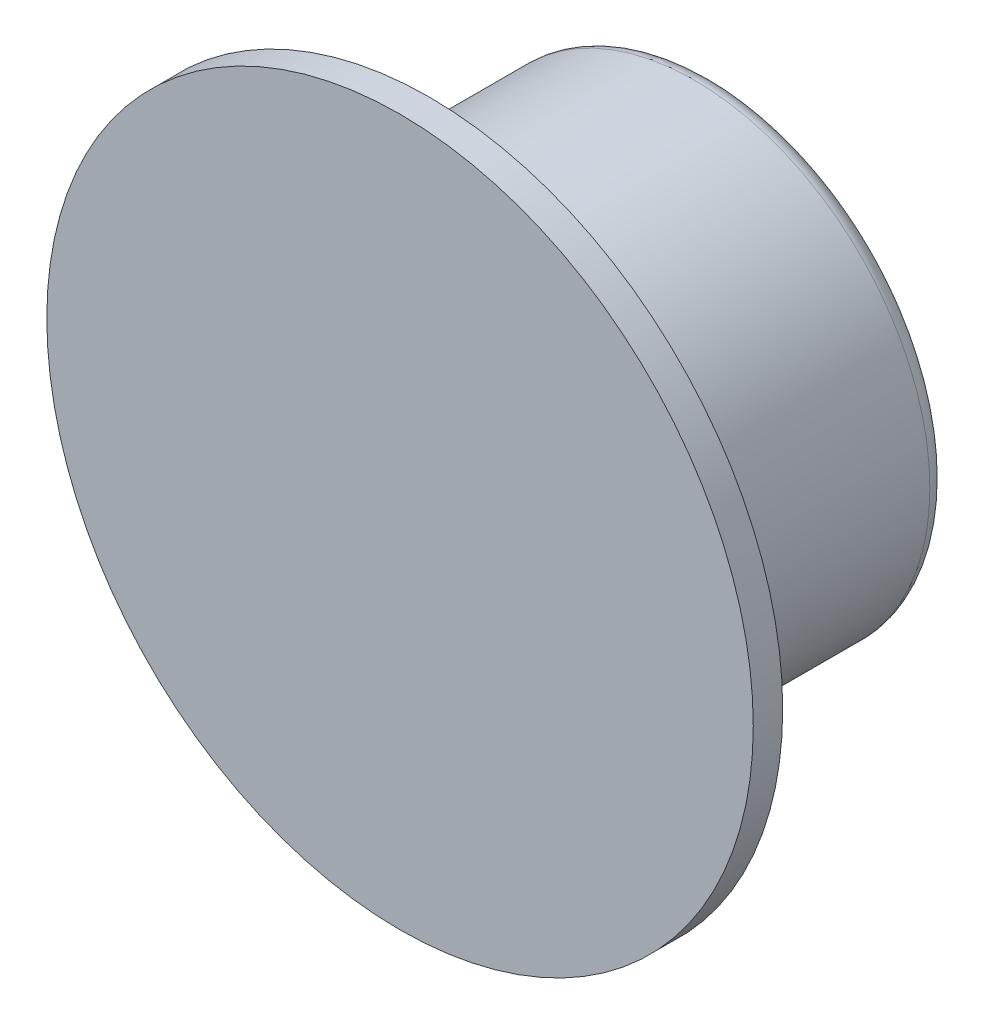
from build123d import *


with BuildPart() as part:
    # Sketch1 → Revolve1 (revolve)
    with BuildSketch(Plane(origin=(0, 0, 0), x_dir=(0, 0, -1), z_dir=(1, 0, 0)), mode=Mode.PRIVATE) as revolve1_sk:
        with BuildLine():
            Line((0, 0), (0, 60))
            Line((0, 60), (5, 60))
            Line((5, 60), (5, 40))
            Line((5, 40), (50, 40))
            ThreePointArc((50, 40), (52.121320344, 39.121320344), (53, 37))
            Line((53, 37), (53, 5))
            Line((53, 5), (52, 4))
            Line((52, 4), (44, 4))
            Line((44, 4), (41.690598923, 0))
            Line((41.690598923, 0), (0, 0))
        make_face()
    revolve(revolve1_sk.sketch.rotate(Axis((0, 0, 0), (0, 0, -1)), 90), axis=Axis((0, 0, 0), (0, 0, -1)))


solid = part.part
